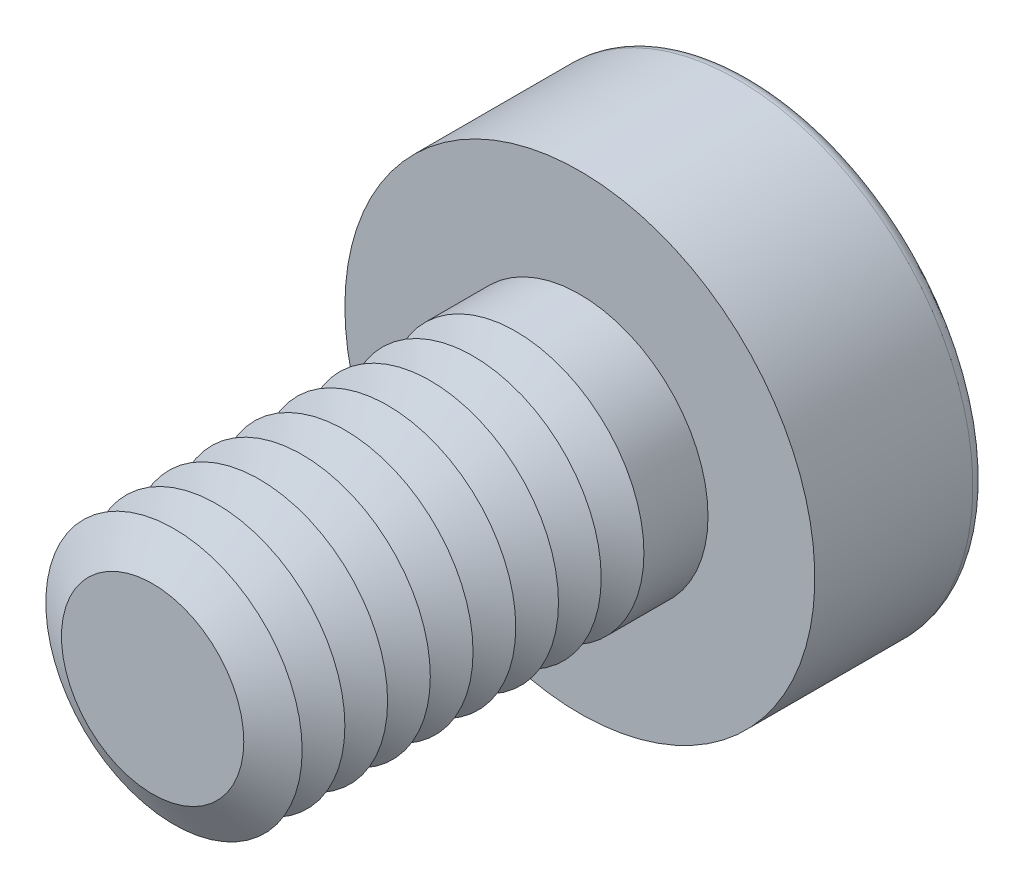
from build123d import *

# Parameters (mm, degrees)
SKETCH1_R           = 1.5
BOSS_EXTRUDE1_DEPTH = 5
SKETCH2_R           = 2.75
BOSS_EXTRUDE2_DEPTH = 2
CUT_EXTRUDE1_DEPTH  = 1.5
FILLET1_R           = 0.15
LPATTERN1_COUNT     = 9
LPATTERN1_PITCH     = 0.5


with BuildPart() as part:
    # Sketch1 → Boss-Extrude1 (new body)
    with BuildSketch(Plane.XY):
        Circle(SKETCH1_R)
    extrude(amount=BOSS_EXTRUDE1_DEPTH)

    # Sketch2 → Boss-Extrude2 (add)
    with BuildSketch(Plane(origin=(0, 0, 0), x_dir=(-1, 0, 0), z_dir=(0, 0, -1))):
        Circle(SKETCH2_R)
    extrude(amount=BOSS_EXTRUDE2_DEPTH)

    # Sketch3 → Cut-Extrude1 (cut)
    with BuildSketch(Plane(origin=(0, 0, -2), x_dir=(-1, 0, 0), z_dir=(0, 0, -1))):
        Polygon((-0.577350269, 1), (-1.154700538, 0), (-0.577350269, -1), (0.577350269, -1), (1.154700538, 0), (0.577350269, 1), align=None)
    extrude(amount=-CUT_EXTRUDE1_DEPTH, mode=Mode.SUBTRACT)

    # Fillet1
    fillet1_edges = [part.edges().sort_by_distance(p)[0] for p in [
        (2.75, 0, -2),
    ]]
    fillet(fillet1_edges, radius=FILLET1_R)

    # Cut-Extrude2 cone 1 section (on through the dimple's axis) → Cut-Extrude2 (revolve, cut)
    with BuildSketch(Plane(origin=(0, 0, -0.5), x_dir=(0, 1, 0), z_dir=(1, 0, 0))):
        Polygon((0, 0), (1, 0), (0, 0.577350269), align=None)
    revolve(axis=Axis((0, 0, -0.5), (0, 0, 1)), mode=Mode.SUBTRACT)

    # Cut-Extrude3 cone 1 section (on through the dimple's axis) → Cut-Extrude3 (revolve, cut)
    with BuildSketch(Plane(origin=(0, 0, -2), x_dir=(0, 1, 0), z_dir=(1, 0, 0))):
        Polygon((0, 0), (1.154700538, 0), (0, 0.309401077), align=None)
    revolve(axis=Axis((0, 0, -2), (0, 0, 1)), mode=Mode.SUBTRACT)

    # Sketch7 → Cut-Revolve1 (revolve, cut)
    with BuildSketch(Plane(origin=(0, 0, 0), x_dir=(0, 0, -1), z_dir=(1, 0, 0)), mode=Mode.PRIVATE) as cut_revolve1_sk:
        Polygon((-5, 1.066987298), (-4.75, 1.5), (-5.25, 1.5), align=None)
    cut_revolve1 = revolve(cut_revolve1_sk.sketch.rotate(Axis((0, 0, 5), (0, 0, -1)), 90), axis=Axis((0, 0, 5), (0, 0, -1)), mode=Mode.SUBTRACT)

    # LPattern1: Cut-Revolve1 ×9
    with Locations(*[(0, 0, -i * LPATTERN1_PITCH) for i in range(1, LPATTERN1_COUNT)]):
        add(cut_revolve1, mode=Mode.SUBTRACT)


solid = part.part
